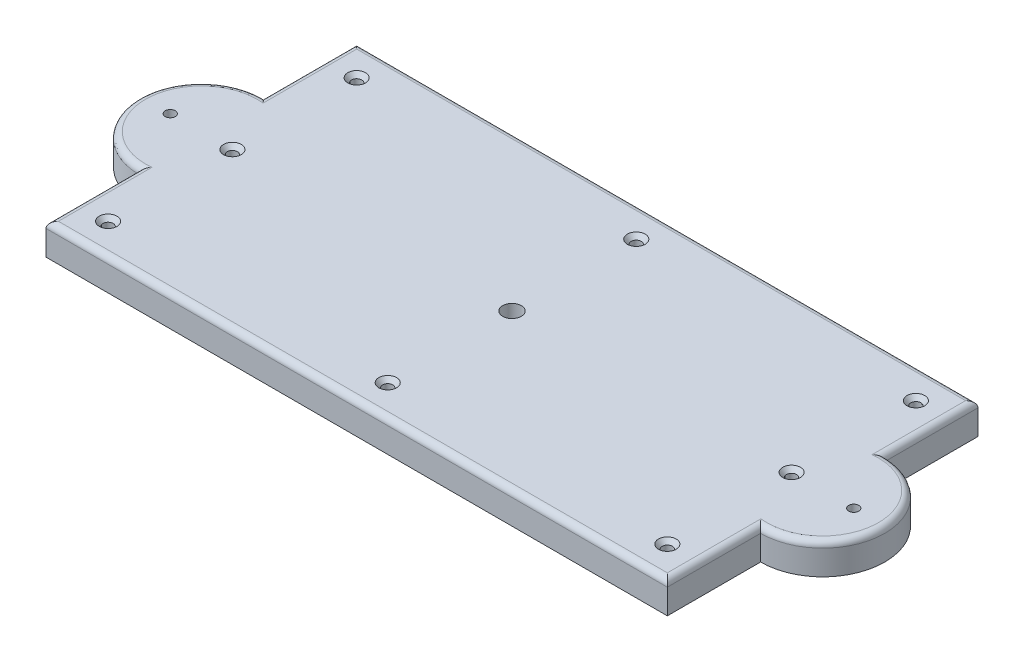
from build123d import *

# Parameters (mm, degrees)
BOSS_EXTRUDE1_DEPTH                            = 10
CSK_FOR_4_FLAT_HEAD_MACHINE_SCREW1_D           = 3.2639
CSK_FOR_4_FLAT_HEAD_MACHINE_SCREW1_CSINK_D     = 5.715
CSK_FOR_4_FLAT_HEAD_MACHINE_SCREW1_CSINK_ANGLE = 82
CSK_FOR_4_FLAT_HEAD_MACHINE_SCREW2_D           = 3.2639
CSK_FOR_4_FLAT_HEAD_MACHINE_SCREW2_CSINK_D     = 5.715
CSK_FOR_4_FLAT_HEAD_MACHINE_SCREW2_CSINK_ANGLE = 82
FILLET1_R                                      = 2
SKETCH8_R                                      = 3
CUT_EXTRUDE1_DEPTH                             = 10


with BuildPart() as part:
    # Sketch1 → Boss-Extrude1 (new body)
    with BuildSketch(Plane(origin=(0, 0, 0), x_dir=(1, 0, 0), z_dir=(0, 1, 0))):
        with BuildLine():
            Line((0, 0), (200, 0))
            Line((200, 0), (200, 30))
            ThreePointArc((200, 30), (220, 50), (200, 70))
            Line((200, 70), (200, 100))
            Line((200, 100), (0, 100))
            Line((0, 100), (0, 70))
            ThreePointArc((0, 70), (-20, 50), (0, 30))
            Line((0, 30), (0, 0))
        make_face()
    extrude(amount=BOSS_EXTRUDE1_DEPTH)

    # CSK for _4 Flat Head Machine Screw1 (through all)
    with Locations(Plane(origin=(0, 10, 0), x_dir=(1, 0, 0), z_dir=(0, 1, 0))):
        with Locations((10, 90), (10, 50), (10, 10), (100, 90), (190, 90), (190, 50), (190, 10), (100, 10)):
            CounterSinkHole(CSK_FOR_4_FLAT_HEAD_MACHINE_SCREW1_D / 2, CSK_FOR_4_FLAT_HEAD_MACHINE_SCREW1_CSINK_D / 2, counter_sink_angle=CSK_FOR_4_FLAT_HEAD_MACHINE_SCREW1_CSINK_ANGLE)

    # CSK for _4 Flat Head Machine Screw2 (through all)
    with Locations(Plane(origin=(0, 0, 0), x_dir=(-1, 0, 0), z_dir=(0, -1, 0))):
        with Locations((-210, 50), (10, 50)):
            CounterSinkHole(CSK_FOR_4_FLAT_HEAD_MACHINE_SCREW2_D / 2, CSK_FOR_4_FLAT_HEAD_MACHINE_SCREW2_CSINK_D / 2, counter_sink_angle=CSK_FOR_4_FLAT_HEAD_MACHINE_SCREW2_CSINK_ANGLE)

    # Fillet1
    fillet1_edges = [part.edges().sort_by_distance(p)[0] for p in [
        (200, 10, -15),
        (220, 10, -50),
        (200, 10, -85),
        (100, 10, -100),
        (0, 10, -85),
        (-20, 10, -50),
        (0, 10, -15),
        (100, 10, 0),
    ]]
    fillet(fillet1_edges, radius=FILLET1_R)

    # Sketch8 → Cut-Extrude1 (cut)
    with BuildSketch(Plane(origin=(0, 10, 0), x_dir=(1, 0, 0), z_dir=(0, 1, 0))):
        with Locations(Location((100, 50, 0), (0, 0, 270))):
            Circle(SKETCH8_R)
    extrude(amount=-CUT_EXTRUDE1_DEPTH, mode=Mode.SUBTRACT)


solid = part.part
